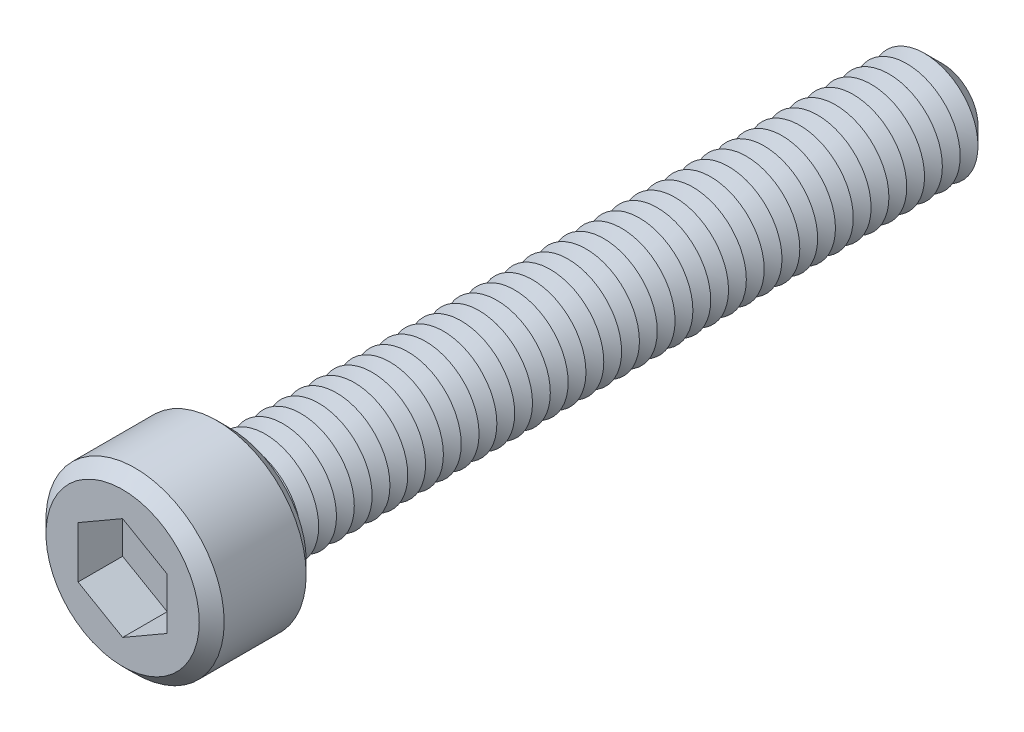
from build123d import *

# Parameters (mm, degrees)
SKETCH1_R           = 5
BOSS_EXTRUDE1_DEPTH = 6
SKETCH2_R           = 3
BOSS_EXTRUDE2_DEPTH = 40
CHAMFER1_SIZE       = 1
LPATTERN1_COUNT     = 39
LPATTERN1_PITCH     = 1
CUT_EXTRUDE1_DEPTH  = 2.5
SKETCH6_R           = 0.8
CUT_EXTRUDE2_DEPTH  = 43.5
CHAMFER2_SIZE       = 0.7


with BuildPart() as part:
    # Sketch1 → Boss-Extrude1 (new body)
    with BuildSketch(Plane.XY):
        Circle(SKETCH1_R)
    extrude(amount=BOSS_EXTRUDE1_DEPTH)

    # Sketch2 → Boss-Extrude2 (add)
    with BuildSketch(Plane(origin=(0, 0, 0), x_dir=(-1, 0, 0), z_dir=(0, 0, -1))):
        Circle(SKETCH2_R)
    extrude(amount=BOSS_EXTRUDE2_DEPTH)

    # Chamfer1
    chamfer1_edges = [part.edges().sort_by_distance(p)[0] for p in [
        (3, 0, -40),
    ]]
    chamfer(chamfer1_edges, length=CHAMFER1_SIZE)

    # Sketch4 → Cut-Revolve1 (revolve, cut)
    with BuildSketch(Plane(origin=(0, 0, 0), x_dir=(0, 0, -1), z_dir=(1, 0, 0)), mode=Mode.PRIVATE) as cut_revolve1_sk:
        Polygon((0, 3), (0.5, 2.133974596), (1, 3), align=None)
    cut_revolve1 = revolve(cut_revolve1_sk.sketch.rotate(Axis((0, 0, 2.512122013), (0, 0, -1)), 90), axis=Axis((0, 0, 2.512122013), (0, 0, -1)), mode=Mode.SUBTRACT)

    # LPattern1: Cut-Revolve1 ×39
    with Locations(*[(0, 0, -i * LPATTERN1_PITCH) for i in range(1, LPATTERN1_COUNT)]):
        add(cut_revolve1, mode=Mode.SUBTRACT)

    # Sketch5 → Cut-Extrude1 (cut)
    with BuildSketch(Plane.XY.offset(6)):
        Polygon((0, 2.886751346), (-2.5, 1.443375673), (-2.5, -1.443375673), (0, -2.886751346), (2.5, -1.443375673), (2.5, 1.443375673), align=None)
    extrude(amount=-CUT_EXTRUDE1_DEPTH, mode=Mode.SUBTRACT)

    # Sketch6 → Cut-Extrude2 (cut)
    with BuildSketch(Plane.XY.offset(3.5)):
        Circle(SKETCH6_R)
    extrude(amount=-CUT_EXTRUDE2_DEPTH, mode=Mode.SUBTRACT)

    # Chamfer2
    chamfer2_edges = [part.edges().sort_by_distance(p)[0] for p in [
        (-5, 0, 0),
        (-5, 0, 6),
    ]]
    chamfer(chamfer2_edges, length=CHAMFER2_SIZE)


solid = part.part
